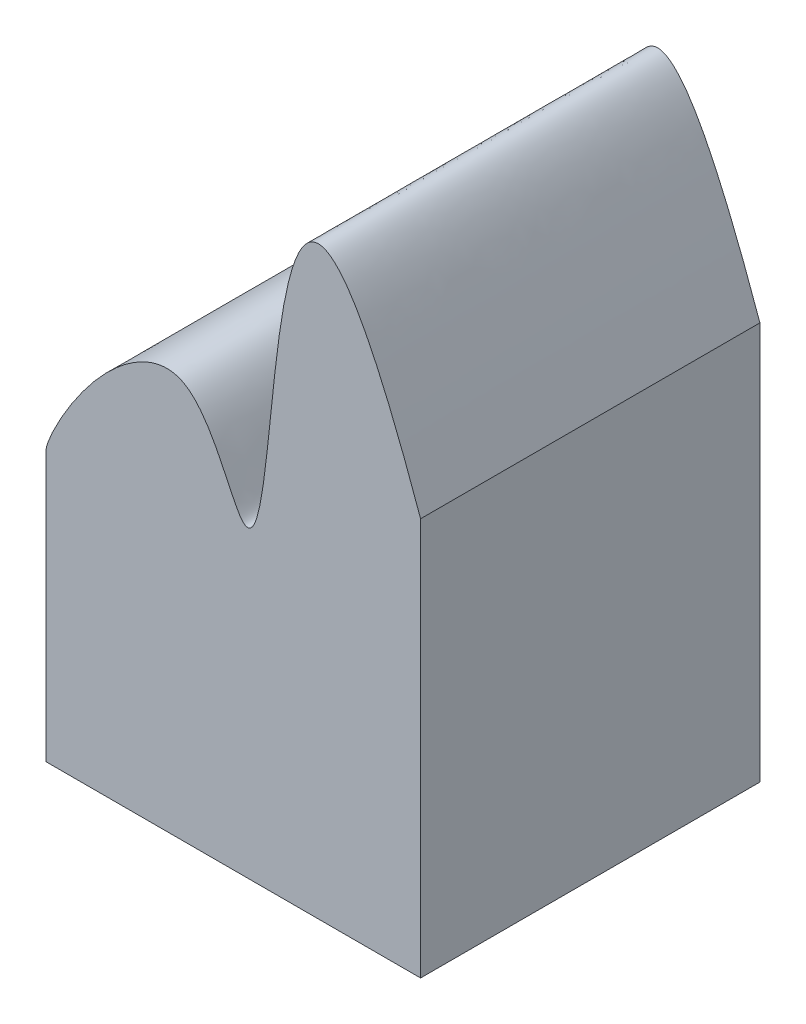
from build123d import *

# Parameters (mm, degrees)
BOSS_EXTRUDE1_DEPTH = 39


with BuildPart() as part:
    # Sketch1 → Boss-Extrude1 (new, symmetric)
    with BuildSketch(Plane.XY):
        with BuildLine():
            Line((0, 61.989019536), (0, 0))
            Line((0, 0), (86.085641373, 0))
            Line((86.085641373, 0), (86.085641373, 91.420008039))
            add(Edge.make_bspline(
                [(86.085641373, 91.420008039), (45.884359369, 204.837680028), (58.709598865, 19.277471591), (34.544390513, 99.389092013), (10.018667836, 84.307996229), (0, 64.405168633), (0, 61.989019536)],
                knots=[0, 0, 0, 0, 0.586790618, 0.733155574, 0.85227679, 1, 1, 1, 1], degree=3))
        make_face()
    extrude(amount=BOSS_EXTRUDE1_DEPTH, both=True)


solid = part.part
